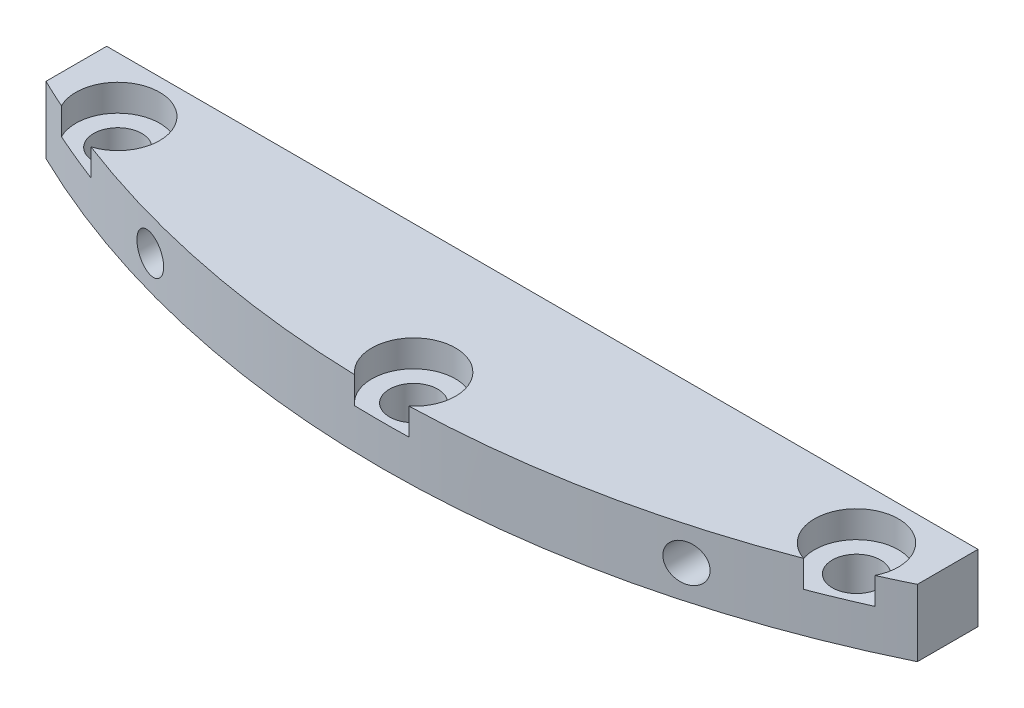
from build123d import *

# Parameters (mm, degrees)
SKETCH1_R          = 2.286
EXTRUDE1_DEPTH     = 6.35
SKETCH2_R          = 1.7526
CUT_EXTRUDE1_DEPTH = 45.45453547
SKETCH3_R          = 3.96875
CUT_EXTRUDE2_DEPTH = 2.54


with BuildPart() as part:
    # Sketch1 → Extrude1 (new body)
    with BuildSketch(Plane(origin=(0, 0, 0), x_dir=(1, 0, 0), z_dir=(0, 1, 0))):
        with BuildLine():
            Line((-41.275, -79.248000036), (-41.275, -84.996214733))
            ThreePointArc((-41.275, -84.996214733), (0, -94.488), (41.275, -84.996214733))
            Line((41.275, -84.996214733), (41.275, -79.248000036))
            Line((41.275, -79.248000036), (-41.275, -79.248000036))
        make_face()
        with Locations(Location((34.992573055, -84.479544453, 0), (0, 0, 90))):
            Circle(SKETCH1_R, mode=Mode.SUBTRACT)
        with Locations(Location((-34.992573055, -84.479544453, 0), (0, 0, 270))):
            Circle(SKETCH1_R, mode=Mode.SUBTRACT)
        with Locations(Location((0, -91.440000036, 0), (0, 0, 270))):
            Circle(SKETCH1_R, mode=Mode.SUBTRACT)
    extrude(amount=EXTRUDE1_DEPTH)

    # Sketch2 → Cut-Extrude1 (cut, through all)
    with BuildSketch(Plane(origin=(0, 0, 79.248000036), x_dir=(-1, 0, 0), z_dir=(0, 0, -1))):
        with Locations((-25.4, 3.175)):
            Circle(SKETCH2_R)
        with Locations((25.4, 3.175)):
            Circle(SKETCH2_R)
    extrude(amount=-CUT_EXTRUDE1_DEPTH, mode=Mode.SUBTRACT)

    # Sketch3 → Cut-Extrude2 (cut)
    with BuildSketch(Plane(origin=(0, 6.35, 0), x_dir=(1, 0, 0), z_dir=(0, 1, 0))):
        with Locations((34.992573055, -84.479544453)):
            Circle(SKETCH3_R)
        with Locations((0, -91.440000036)):
            Circle(SKETCH3_R)
        with Locations((-34.992573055, -84.479544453)):
            Circle(SKETCH3_R)
    extrude(amount=-CUT_EXTRUDE2_DEPTH, mode=Mode.SUBTRACT)


solid = part.part
